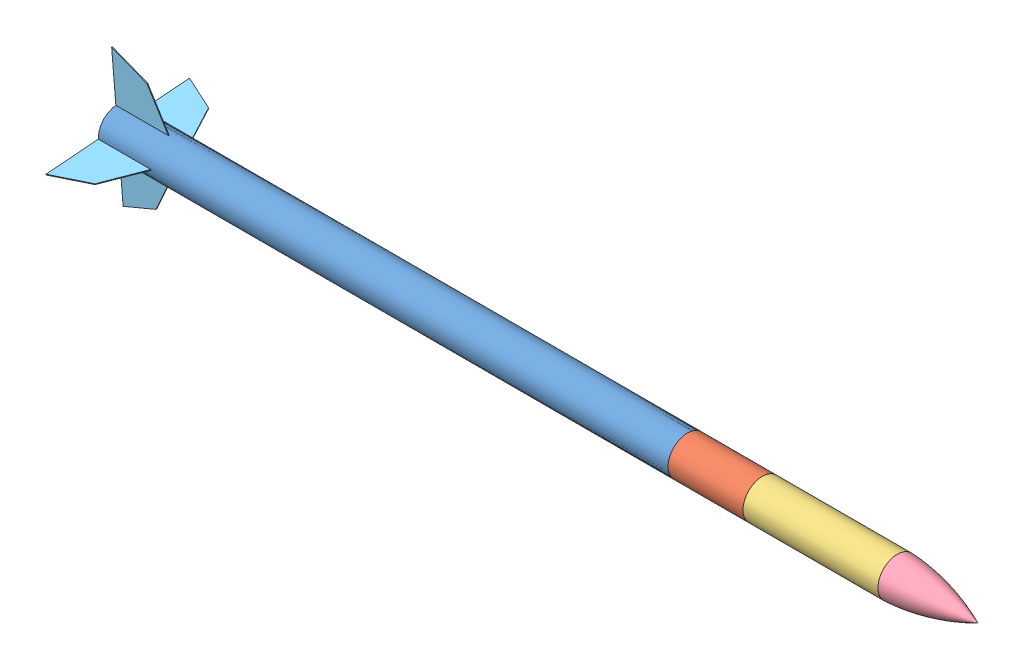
SolidWorks assembly montagemsuperficie.SLDASM, configuration Valor predeterminado (file format 14000). Lengths in mm.
Overall size (1147.55 191.48 191.48).
8 component instances, 5 part files, 19 mates.
Components (placement in the parent):
- corposupmain-1: corposupmain.SLDPRT [Valor predeterminado] at (-30.0801 52.9186 760) x (0 1 0) z (1 0 0) size (52 52 760)
- conector-1: conector.SLDPRT [Valor predeterminado] at (399.9199 52.9186 760) x (0 1 0) z (1 0 0) size (52 52 150)
- contcone-1: contcone.SLDPRT [Valor predeterminado] at (539.9199 52.9186 760) x (0 0.993297 0.115589) z (1 0 0) size (52 52 180)
- conesup-1: conesup.SLDPRT [Valor predeterminado] at (737.4618 52.9186 760) x (-1 0 0) z (0 1 0) size (107.54 52 52)
- stablesup-1: stablesup.SLDPRT [Valor predeterminado] at (-375.0801 78.7961 762.5703) x (-1 0 0) z (0 0.079689 -0.99682) size (70.01 70.01 1.01)
- stablesup-2: stablesup.SLDPRT [Valor predeterminado] at (-375.0801 50.3483 785.8775) x (-1 0 0) z (0 0.99682 0.079689) size (70.01 70.01 1.01)
- stablesup-3: stablesup.SLDPRT [Valor predeterminado] at (-375.0801 27.0412 757.4297) x (-1 0 0) z (0 -0.079689 0.99682) size (70.01 70.01 1.01)
- stablesup-4: stablesup.SLDPRT [Valor predeterminado] at (-375.0801 55.4889 734.1225) x (-1 0 0) z (0 -0.99682 -0.079689) size (70.01 70.01 1.01)
Mates (geometry in assembly coordinates):
- Concêntrico1: concentric aligned: circle of corposupmain-1; circle of conector-1
- Coincidente3: coincident anti-aligned: plane of corposupmain-1 through (349.9199 52.9186 760) normal (1 0 0); plane of conector-1 through (349.9199 52.9186 760) normal (-1 0 0)
- Concêntrico3: concentric aligned: circle of conector-1; circle of contcone-1
- Coincidente5: coincident anti-aligned: plane of conector-1 through (449.9199 52.9186 760) normal (1 0 0); plane of contcone-1 through (449.9199 52.9186 760) normal (-1 0 0)
- Concêntrico4: concentric anti-aligned: circle of contcone-1; circle of conesup-1
- Bloquear2: lock: unknown of contcone-1; unknown of conesup-1
- Bloquear3: lock: unknown of conector-1; unknown of contcone-1
- Bloquear4: lock: unknown of corposupmain-1; unknown of conector-1
- Coincidente8: coincident aligned: plane of corposupmain-1 through (-410.0801 52.9186 760) normal (-1 0 0); plane of stablesup-1 through (-410.0801 78.8758 761.5735) normal (-1 0 0)
- Tangente2: tangent anti-aligned: cylinder of corposupmain-1 through (349.9199 52.9186 760) axis (-1 0 0) radius 26; plane of stablesup-1 through (-410.0801 78.8758 761.5735) normal (0 -0.99682 -0.079689)
- Coincidente9: coincident aligned: plane of corposupmain-1 through (-410.0801 52.9186 760) normal (-1 0 0); plane of stablesup-2 through (-410.0801 51.3451 785.9572) normal (-1 0 0)
- Tangente6: tangent anti-aligned: cylinder of corposupmain-1 through (349.9199 52.9186 760) axis (-1 0 0) radius 26; plane of stablesup-2 through (-410.0801 51.3451 785.9572) normal (0 0.079689 -0.99682)
- Bloquear5: lock: unknown of corposupmain-1; unknown of stablesup-2
- Tangente10: tangent anti-aligned: cylinder of corposupmain-1 through (349.9199 52.9186 760) axis (-1 0 0) radius 26; plane of stablesup-3 through (-410.0801 26.9615 758.4265) normal (0 0.99682 0.079689)
- Coincidente10: coincident aligned: plane of corposupmain-1 through (-410.0801 52.9186 760) normal (-1 0 0); plane of stablesup-3 through (-410.0801 26.9615 758.4265) normal (-1 0 0)
- Bloquear7: lock: unknown of corposupmain-1; unknown of stablesup-3
- Tangente13: tangent anti-aligned: cylinder of corposupmain-1 through (349.9199 52.9186 760) axis (-1 0 0) radius 26; plane of stablesup-4 through (-410.0801 54.4921 734.0428) normal (0 -0.079689 0.99682)
- Coincidente12: coincident aligned: plane of corposupmain-1 through (-410.0801 52.9186 760) normal (-1 0 0); plane of stablesup-4 through (-410.0801 54.4921 734.0428) normal (-1 0 0)
- Bloquear8: lock: unknown of corposupmain-1; unknown of stablesup-4
